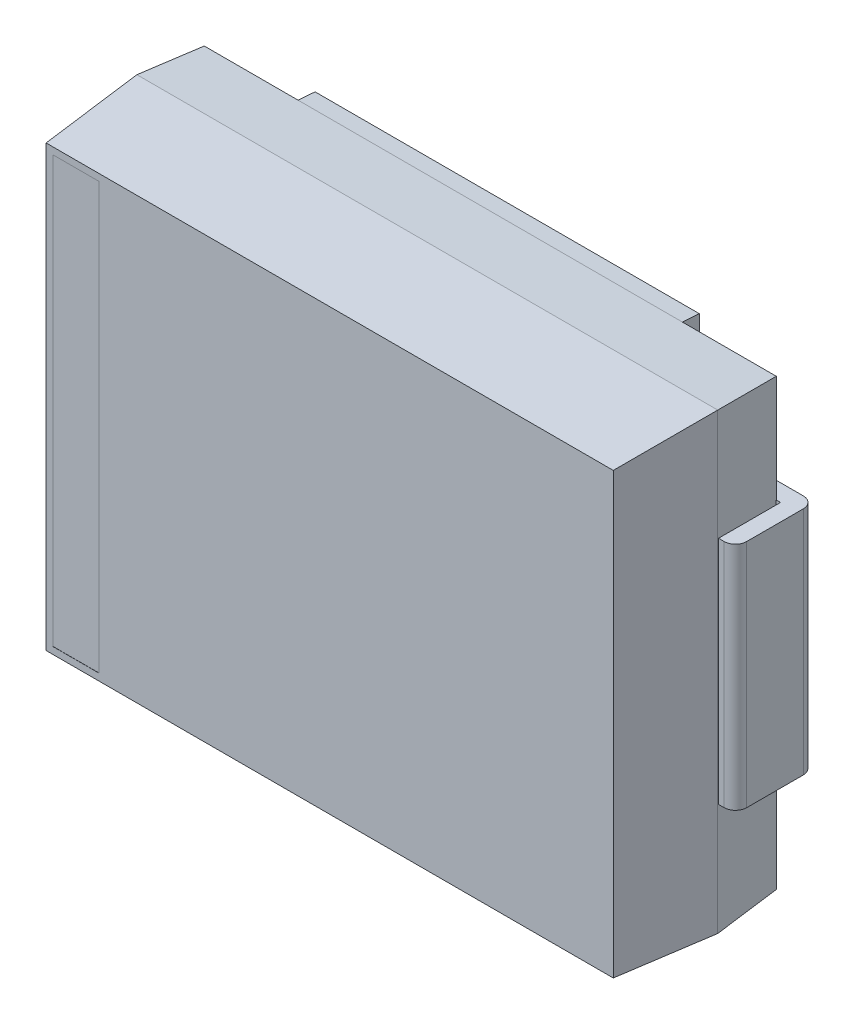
ISO-10303-21;
HEADER;
FILE_DESCRIPTION(('STEP AP214'),'2;1');
FILE_NAME('part.step','',(''),(''),'','','');
FILE_SCHEMA(('AUTOMOTIVE_DESIGN { 1 0 10303 214 1 1 1 1 }'));
ENDSEC;
DATA;
#1=APPLICATION_CONTEXT('core data for automotive mechanical design processes');
#2=APPLICATION_PROTOCOL_DEFINITION('international standard','automotive_design',2000,#1);
#3=PRODUCT_CONTEXT('',#1,'mechanical');
#4=PRODUCT('Part','Part','',(#3));
#5=PRODUCT_RELATED_PRODUCT_CATEGORY('part','',(#4));
#6=PRODUCT_DEFINITION_FORMATION('','',#4);
#7=PRODUCT_DEFINITION_CONTEXT('part definition',#1,'design');
#8=PRODUCT_DEFINITION('design','',#6,#7);
#9=PRODUCT_DEFINITION_SHAPE('','',#8);
#10=(LENGTH_UNIT() NAMED_UNIT(*) SI_UNIT(.MILLI.,.METRE.));
#11=(NAMED_UNIT(*) PLANE_ANGLE_UNIT() SI_UNIT($,.RADIAN.));
#12=(NAMED_UNIT(*) SI_UNIT($,.STERADIAN.) SOLID_ANGLE_UNIT());
#13=UNCERTAINTY_MEASURE_WITH_UNIT(LENGTH_MEASURE(1.E-05),#10,'distance_accuracy_value','');
#14=(GEOMETRIC_REPRESENTATION_CONTEXT(3) GLOBAL_UNCERTAINTY_ASSIGNED_CONTEXT((#13)) GLOBAL_UNIT_ASSIGNED_CONTEXT((#10,
#11,#12)) REPRESENTATION_CONTEXT('',''));
#15=CARTESIAN_POINT('',(0.,0.,0.));
#16=DIRECTION('',(0.,0.,1.));
#17=DIRECTION('',(1.,0.,0.));
#18=AXIS2_PLACEMENT_3D('',#15,#16,#17);
#19=CARTESIAN_POINT('',(-3.001442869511,-2.771442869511,2.3078));
#20=DIRECTION('',(0.,0.,-1.));
#21=DIRECTION('',(0.,-1.,0.));
#22=AXIS2_PLACEMENT_3D('',#19,#20,#21);
#23=PLANE('',#22);
#24=DIRECTION('',(0.,1.,0.));
#25=VECTOR('',#24,1.);
#26=CARTESIAN_POINT('',(-3.001442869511,-2.771442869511,2.3078));
#27=LINE('',#26,#25);
#28=CARTESIAN_POINT('',(-3.001442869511,-2.771442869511,2.3078));
#29=VERTEX_POINT('',#28);
#30=CARTESIAN_POINT('',(-3.001442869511,2.771442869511,2.3078));
#31=VERTEX_POINT('',#30);
#32=EDGE_CURVE('E211',#29,#31,#27,.T.);
#33=ORIENTED_EDGE('',*,*,#32,.T.);
#34=DIRECTION('',(-1.,0.,0.));
#35=VECTOR('',#34,1.);
#36=CARTESIAN_POINT('',(-3.001442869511,2.771442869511,2.3078));
#37=LINE('',#36,#35);
#38=CARTESIAN_POINT('',(-3.601442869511,2.771442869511,2.3078));
#39=VERTEX_POINT('',#38);
#40=EDGE_CURVE('E461',#31,#39,#37,.T.);
#41=ORIENTED_EDGE('',*,*,#40,.T.);
#42=DIRECTION('',(0.,-1.,0.));
#43=VECTOR('',#42,1.);
#44=CARTESIAN_POINT('',(-3.601442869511,2.771442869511,2.3078));
#45=LINE('',#44,#43);
#46=CARTESIAN_POINT('',(-3.601442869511,-2.771442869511,2.3078));
#47=VERTEX_POINT('',#46);
#48=EDGE_CURVE('E39',#39,#47,#45,.T.);
#49=ORIENTED_EDGE('',*,*,#48,.T.);
#50=DIRECTION('',(1.,0.,0.));
#51=VECTOR('',#50,1.);
#52=CARTESIAN_POINT('',(-3.601442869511,-2.771442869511,2.3078));
#53=LINE('',#52,#51);
#54=EDGE_CURVE('E350',#47,#29,#53,.T.);
#55=ORIENTED_EDGE('',*,*,#54,.T.);
#56=EDGE_LOOP('',(#33,#41,#49,#55));
#57=FACE_BOUND('',#56,.T.);
#58=ADVANCED_FACE('F17',(#57),#23,.F.);
#59=CARTESIAN_POINT('',(-4.,-1.5,0.));
#60=DIRECTION('',(-1.,0.,0.));
#61=DIRECTION('',(0.,0.,1.));
#62=AXIS2_PLACEMENT_3D('',#59,#60,#61);
#63=PLANE('',#62);
#64=DIRECTION('',(0.,0.,1.));
#65=VECTOR('',#64,1.);
#66=CARTESIAN_POINT('',(-4.,-1.5,0.));
#67=LINE('',#66,#65);
#68=CARTESIAN_POINT('',(-4.,-1.5,0.146666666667));
#69=VERTEX_POINT('',#68);
#70=CARTESIAN_POINT('',(-4.,-1.5,0.882438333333));
#71=VERTEX_POINT('',#70);
#72=EDGE_CURVE('E728',#69,#71,#67,.T.);
#73=ORIENTED_EDGE('',*,*,#72,.T.);
#74=DIRECTION('',(0.,1.,0.));
#75=VECTOR('',#74,1.);
#76=CARTESIAN_POINT('',(-4.,-1.5,0.882438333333));
#77=LINE('',#76,#75);
#78=CARTESIAN_POINT('',(-4.,1.5,0.882438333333));
#79=VERTEX_POINT('',#78);
#80=EDGE_CURVE('E11',#71,#79,#77,.T.);
#81=ORIENTED_EDGE('',*,*,#80,.T.);
#82=DIRECTION('',(0.,0.,1.));
#83=VECTOR('',#82,1.);
#84=CARTESIAN_POINT('',(-4.,1.5,0.));
#85=LINE('',#84,#83);
#86=CARTESIAN_POINT('',(-4.,1.5,0.146666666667));
#87=VERTEX_POINT('',#86);
#88=EDGE_CURVE('E447',#87,#79,#85,.T.);
#89=ORIENTED_EDGE('',*,*,#88,.F.);
#90=DIRECTION('',(0.,1.,0.));
#91=VECTOR('',#90,1.);
#92=CARTESIAN_POINT('',(-4.,-1.5,0.146666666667));
#93=LINE('',#92,#91);
#94=EDGE_CURVE('E543',#69,#87,#93,.T.);
#95=ORIENTED_EDGE('',*,*,#94,.F.);
#96=EDGE_LOOP('',(#73,#81,#89,#95));
#97=FACE_BOUND('',#96,.T.);
#98=ADVANCED_FACE('F919',(#97),#63,.T.);
#99=CARTESIAN_POINT('',(-3.853333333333,-1.5,0.882438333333));
#100=DIRECTION('',(0.,1.,0.));
#101=DIRECTION('',(-1.,0.,0.));
#102=AXIS2_PLACEMENT_3D('',#99,#100,#101);
#103=CYLINDRICAL_SURFACE('',#102,0.146666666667);
#104=CARTESIAN_POINT('',(-3.853333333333,-1.5,0.882438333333));
#105=DIRECTION('',(0.,1.,0.));
#106=DIRECTION('',(0.,0.,1.));
#107=AXIS2_PLACEMENT_3D('',#104,#105,#106);
#108=CIRCLE('',#107,0.146666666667);
#109=CARTESIAN_POINT('',(-3.853333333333,-1.5,1.029105));
#110=VERTEX_POINT('',#109);
#111=EDGE_CURVE('E741',#71,#110,#108,.T.);
#112=ORIENTED_EDGE('',*,*,#111,.T.);
#113=DIRECTION('',(0.,1.,0.));
#114=VECTOR('',#113,1.);
#115=CARTESIAN_POINT('',(-3.853333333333,-1.5,1.029105));
#116=LINE('',#115,#114);
#117=CARTESIAN_POINT('',(-3.853333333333,1.5,1.029105));
#118=VERTEX_POINT('',#117);
#119=EDGE_CURVE('E26',#110,#118,#116,.T.);
#120=ORIENTED_EDGE('',*,*,#119,.T.);
#121=CARTESIAN_POINT('',(-3.853333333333,1.5,0.882438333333));
#122=DIRECTION('',(0.,1.,0.));
#123=DIRECTION('',(0.,0.,1.));
#124=AXIS2_PLACEMENT_3D('',#121,#122,#123);
#125=CIRCLE('',#124,0.146666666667);
#126=EDGE_CURVE('E442',#79,#118,#125,.T.);
#127=ORIENTED_EDGE('',*,*,#126,.F.);
#128=ORIENTED_EDGE('',*,*,#80,.F.);
#129=EDGE_LOOP('',(#112,#120,#127,#128));
#130=FACE_BOUND('',#129,.T.);
#131=ADVANCED_FACE('F922',(#130),#103,.T.);
#132=CARTESIAN_POINT('',(-3.89,0.,1.029105));
#133=DIRECTION('',(0.,0.,-1.));
#134=DIRECTION('',(0.,-1.,0.));
#135=AXIS2_PLACEMENT_3D('',#132,#133,#134);
#136=PLANE('',#135);
#137=DIRECTION('',(0.,-1.,0.));
#138=VECTOR('',#137,1.);
#139=CARTESIAN_POINT('',(-3.78,1.5,1.029105));
#140=LINE('',#139,#138);
#141=CARTESIAN_POINT('',(-3.78,1.5,1.029105));
#142=VERTEX_POINT('',#141);
#143=CARTESIAN_POINT('',(-3.78,-1.5,1.029105));
#144=VERTEX_POINT('',#143);
#145=EDGE_CURVE('E687',#142,#144,#140,.T.);
#146=ORIENTED_EDGE('',*,*,#145,.F.);
#147=DIRECTION('',(1.,0.,0.));
#148=VECTOR('',#147,1.);
#149=CARTESIAN_POINT('',(-4.,1.5,1.029105));
#150=LINE('',#149,#148);
#151=EDGE_CURVE('E446',#118,#142,#150,.T.);
#152=ORIENTED_EDGE('',*,*,#151,.F.);
#153=ORIENTED_EDGE('',*,*,#119,.F.);
#154=DIRECTION('',(-1.,0.,0.));
#155=VECTOR('',#154,1.);
#156=CARTESIAN_POINT('',(-3.78,-1.5,1.029105));
#157=LINE('',#156,#155);
#158=EDGE_CURVE('E568',#144,#110,#157,.T.);
#159=ORIENTED_EDGE('',*,*,#158,.F.);
#160=EDGE_LOOP('',(#146,#152,#153,#159));
#161=FACE_BOUND('',#160,.T.);
#162=ADVANCED_FACE('F763',(#161),#136,.F.);
#163=CARTESIAN_POINT('',(-3.78,1.5,0.));
#164=DIRECTION('',(1.,0.,0.));
#165=DIRECTION('',(0.,-1.,0.));
#166=AXIS2_PLACEMENT_3D('',#163,#164,#165);
#167=PLANE('',#166);
#168=DIRECTION('',(0.,1.,0.));
#169=VECTOR('',#168,1.);
#170=CARTESIAN_POINT('',(-3.78,-1.5,0.2222));
#171=LINE('',#170,#169);
#172=CARTESIAN_POINT('',(-3.78,-1.5,0.2222));
#173=VERTEX_POINT('',#172);
#174=CARTESIAN_POINT('',(-3.78,1.5,0.2222));
#175=VERTEX_POINT('',#174);
#176=EDGE_CURVE('E744',#173,#175,#171,.T.);
#177=ORIENTED_EDGE('',*,*,#176,.T.);
#178=DIRECTION('',(0.,0.,1.));
#179=VECTOR('',#178,1.);
#180=CARTESIAN_POINT('',(-3.78,1.5,0.));
#181=LINE('',#180,#179);
#182=EDGE_CURVE('E680',#175,#142,#181,.T.);
#183=ORIENTED_EDGE('',*,*,#182,.T.);
#184=ORIENTED_EDGE('',*,*,#145,.T.);
#185=DIRECTION('',(0.,0.,1.));
#186=VECTOR('',#185,1.);
#187=CARTESIAN_POINT('',(-3.78,-1.5,0.));
#188=LINE('',#187,#186);
#189=EDGE_CURVE('E561',#173,#144,#188,.T.);
#190=ORIENTED_EDGE('',*,*,#189,.F.);
#191=EDGE_LOOP('',(#177,#183,#184,#190));
#192=FACE_BOUND('',#191,.T.);
#193=ADVANCED_FACE('F761',(#192),#167,.T.);
#194=CARTESIAN_POINT('',(-3.246666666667,0.,0.));
#195=DIRECTION('',(0.,0.,-1.));
#196=DIRECTION('',(0.,-1.,0.));
#197=AXIS2_PLACEMENT_3D('',#194,#195,#196);
#198=PLANE('',#197);
#199=DIRECTION('',(-1.,0.,0.));
#200=VECTOR('',#199,1.);
#201=CARTESIAN_POINT('',(-3.78,-1.5,0.));
#202=LINE('',#201,#200);
#203=CARTESIAN_POINT('',(-2.64,-1.5,0.));
#204=VERTEX_POINT('',#203);
#205=CARTESIAN_POINT('',(-3.853333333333,-1.5,0.));
#206=VERTEX_POINT('',#205);
#207=EDGE_CURVE('E376',#204,#206,#202,.T.);
#208=ORIENTED_EDGE('',*,*,#207,.T.);
#209=DIRECTION('',(0.,1.,0.));
#210=VECTOR('',#209,1.);
#211=CARTESIAN_POINT('',(-3.853333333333,-1.5,0.));
#212=LINE('',#211,#210);
#213=CARTESIAN_POINT('',(-3.853333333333,1.5,0.));
#214=VERTEX_POINT('',#213);
#215=EDGE_CURVE('E621',#206,#214,#212,.T.);
#216=ORIENTED_EDGE('',*,*,#215,.T.);
#217=DIRECTION('',(1.,0.,0.));
#218=VECTOR('',#217,1.);
#219=CARTESIAN_POINT('',(-3.78,1.5,0.));
#220=LINE('',#219,#218);
#221=CARTESIAN_POINT('',(-2.64,1.5,0.));
#222=VERTEX_POINT('',#221);
#223=EDGE_CURVE('E710',#214,#222,#220,.T.);
#224=ORIENTED_EDGE('',*,*,#223,.T.);
#225=DIRECTION('',(0.,-1.,0.));
#226=VECTOR('',#225,1.);
#227=CARTESIAN_POINT('',(-2.64,1.5,0.));
#228=LINE('',#227,#226);
#229=EDGE_CURVE('E721',#222,#204,#228,.T.);
#230=ORIENTED_EDGE('',*,*,#229,.T.);
#231=EDGE_LOOP('',(#208,#216,#224,#230));
#232=FACE_BOUND('',#231,.T.);
#233=ADVANCED_FACE('F914',(#232),#198,.T.);
#234=CARTESIAN_POINT('',(-3.853333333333,-1.5,0.146666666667));
#235=DIRECTION('',(0.,1.,0.));
#236=DIRECTION('',(-1.,0.,0.));
#237=AXIS2_PLACEMENT_3D('',#234,#235,#236);
#238=CYLINDRICAL_SURFACE('',#237,0.146666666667);
#239=ORIENTED_EDGE('',*,*,#94,.T.);
#240=CARTESIAN_POINT('',(-3.853333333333,1.5,0.146666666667));
#241=DIRECTION('',(0.,-1.,0.));
#242=DIRECTION('',(0.,0.,1.));
#243=AXIS2_PLACEMENT_3D('',#240,#241,#242);
#244=CIRCLE('',#243,0.146666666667);
#245=EDGE_CURVE('E481',#87,#214,#244,.T.);
#246=ORIENTED_EDGE('',*,*,#245,.T.);
#247=ORIENTED_EDGE('',*,*,#215,.F.);
#248=CARTESIAN_POINT('',(-3.853333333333,-1.5,0.146666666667));
#249=DIRECTION('',(0.,-1.,0.));
#250=DIRECTION('',(0.,0.,1.));
#251=AXIS2_PLACEMENT_3D('',#248,#249,#250);
#252=CIRCLE('',#251,0.146666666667);
#253=EDGE_CURVE('E381',#69,#206,#252,.T.);
#254=ORIENTED_EDGE('',*,*,#253,.F.);
#255=EDGE_LOOP('',(#239,#246,#247,#254));
#256=FACE_BOUND('',#255,.T.);
#257=ADVANCED_FACE('F916',(#256),#238,.T.);
#258=CARTESIAN_POINT('',(-3.601442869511,2.771442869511,2.31));
#259=DIRECTION('',(-1.,0.,0.));
#260=DIRECTION('',(0.,0.,1.));
#261=AXIS2_PLACEMENT_3D('',#258,#259,#260);
#262=PLANE('',#261);
#263=CARTESIAN_POINT('',(-3.601442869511,2.771442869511,2.3078));
#264=CARTESIAN_POINT('',(-3.601442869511,2.771442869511,2.31));
#265=(BOUNDED_CURVE() B_SPLINE_CURVE(1,(#263,#264),.UNSPECIFIED.,.F.,
.F.) B_SPLINE_CURVE_WITH_KNOTS((2,2),(0.,1.),
.UNSPECIFIED.) CURVE() GEOMETRIC_REPRESENTATION_ITEM() RATIONAL_B_SPLINE_CURVE((1.,1.)) REPRESENTATION_ITEM(''));
#266=CARTESIAN_POINT('',(-3.601442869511,2.771442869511,2.31));
#267=VERTEX_POINT('',#266);
#268=EDGE_CURVE('E456',#39,#267,#265,.T.);
#269=ORIENTED_EDGE('',*,*,#268,.T.);
#270=DIRECTION('',(0.,-1.,0.));
#271=VECTOR('',#270,1.);
#272=CARTESIAN_POINT('',(-3.601442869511,2.771442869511,2.31));
#273=LINE('',#272,#271);
#274=CARTESIAN_POINT('',(-3.601442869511,-2.771442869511,2.31));
#275=VERTEX_POINT('',#274);
#276=EDGE_CURVE('E631',#267,#275,#273,.T.);
#277=ORIENTED_EDGE('',*,*,#276,.T.);
#278=CARTESIAN_POINT('',(-3.601442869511,-2.771442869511,2.3078));
#279=CARTESIAN_POINT('',(-3.601442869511,-2.771442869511,2.31));
#280=(BOUNDED_CURVE() B_SPLINE_CURVE(1,(#278,#279),.UNSPECIFIED.,.F.,
.F.) B_SPLINE_CURVE_WITH_KNOTS((2,2),(0.,1.),
.UNSPECIFIED.) CURVE() GEOMETRIC_REPRESENTATION_ITEM() RATIONAL_B_SPLINE_CURVE((1.,1.)) REPRESENTATION_ITEM(''));
#281=EDGE_CURVE('E345',#47,#275,#280,.T.);
#282=ORIENTED_EDGE('',*,*,#281,.F.);
#283=ORIENTED_EDGE('',*,*,#48,.F.);
#284=EDGE_LOOP('',(#269,#277,#282,#283));
#285=FACE_BOUND('',#284,.T.);
#286=ADVANCED_FACE('F944',(#285),#262,.F.);
#287=CARTESIAN_POINT('',(-3.601442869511,-2.771442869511,2.31));
#288=DIRECTION('',(0.,-1.,0.));
#289=DIRECTION('',(-1.,0.,0.));
#290=AXIS2_PLACEMENT_3D('',#287,#288,#289);
#291=PLANE('',#290);
#292=ORIENTED_EDGE('',*,*,#281,.T.);
#293=DIRECTION('',(1.,0.,0.));
#294=VECTOR('',#293,1.);
#295=CARTESIAN_POINT('',(-3.601442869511,-2.771442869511,2.31));
#296=LINE('',#295,#294);
#297=CARTESIAN_POINT('',(-3.001442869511,-2.771442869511,2.31));
#298=VERTEX_POINT('',#297);
#299=EDGE_CURVE('E684',#275,#298,#296,.T.);
#300=ORIENTED_EDGE('',*,*,#299,.T.);
#301=CARTESIAN_POINT('',(-3.001442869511,-2.771442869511,2.3078));
#302=CARTESIAN_POINT('',(-3.001442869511,-2.771442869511,2.31));
#303=(BOUNDED_CURVE() B_SPLINE_CURVE(1,(#301,#302),.UNSPECIFIED.,.F.,
.F.) B_SPLINE_CURVE_WITH_KNOTS((2,2),(0.,1.),
.UNSPECIFIED.) CURVE() GEOMETRIC_REPRESENTATION_ITEM() RATIONAL_B_SPLINE_CURVE((1.,1.)) REPRESENTATION_ITEM(''));
#304=EDGE_CURVE('E668',#29,#298,#303,.T.);
#305=ORIENTED_EDGE('',*,*,#304,.F.);
#306=ORIENTED_EDGE('',*,*,#54,.F.);
#307=EDGE_LOOP('',(#292,#300,#305,#306));
#308=FACE_BOUND('',#307,.T.);
#309=ADVANCED_FACE('F948',(#308),#291,.F.);
#310=CARTESIAN_POINT('',(-3.001442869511,-2.771442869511,2.31));
#311=DIRECTION('',(1.,0.,0.));
#312=DIRECTION('',(0.,-1.,0.));
#313=AXIS2_PLACEMENT_3D('',#310,#311,#312);
#314=PLANE('',#313);
#315=ORIENTED_EDGE('',*,*,#304,.T.);
#316=DIRECTION('',(0.,1.,0.));
#317=VECTOR('',#316,1.);
#318=CARTESIAN_POINT('',(-3.001442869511,-2.771442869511,2.31));
#319=LINE('',#318,#317);
#320=CARTESIAN_POINT('',(-3.001442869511,2.771442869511,2.31));
#321=VERTEX_POINT('',#320);
#322=EDGE_CURVE('E676',#298,#321,#319,.T.);
#323=ORIENTED_EDGE('',*,*,#322,.T.);
#324=CARTESIAN_POINT('',(-3.001442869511,2.771442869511,2.3078));
#325=CARTESIAN_POINT('',(-3.001442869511,2.771442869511,2.31));
#326=(BOUNDED_CURVE() B_SPLINE_CURVE(1,(#324,#325),.UNSPECIFIED.,.F.,
.F.) B_SPLINE_CURVE_WITH_KNOTS((2,2),(0.,1.),
.UNSPECIFIED.) CURVE() GEOMETRIC_REPRESENTATION_ITEM() RATIONAL_B_SPLINE_CURVE((1.,1.)) REPRESENTATION_ITEM(''));
#327=EDGE_CURVE('E462',#31,#321,#326,.T.);
#328=ORIENTED_EDGE('',*,*,#327,.F.);
#329=ORIENTED_EDGE('',*,*,#32,.F.);
#330=EDGE_LOOP('',(#315,#323,#328,#329));
#331=FACE_BOUND('',#330,.T.);
#332=ADVANCED_FACE('F957',(#331),#314,.F.);
#333=CARTESIAN_POINT('',(-3.001442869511,2.771442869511,2.31));
#334=DIRECTION('',(0.,1.,0.));
#335=DIRECTION('',(1.,0.,0.));
#336=AXIS2_PLACEMENT_3D('',#333,#334,#335);
#337=PLANE('',#336);
#338=ORIENTED_EDGE('',*,*,#327,.T.);
#339=DIRECTION('',(-1.,0.,0.));
#340=VECTOR('',#339,1.);
#341=CARTESIAN_POINT('',(-3.001442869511,2.771442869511,2.31));
#342=LINE('',#341,#340);
#343=EDGE_CURVE('E627',#321,#267,#342,.T.);
#344=ORIENTED_EDGE('',*,*,#343,.T.);
#345=ORIENTED_EDGE('',*,*,#268,.F.);
#346=ORIENTED_EDGE('',*,*,#40,.F.);
#347=EDGE_LOOP('',(#338,#344,#345,#346));
#348=FACE_BOUND('',#347,.T.);
#349=ADVANCED_FACE('F966',(#348),#337,.F.);
#350=CARTESIAN_POINT('',(-3.21,0.,0.2222));
#351=DIRECTION('',(0.,0.,-1.));
#352=DIRECTION('',(0.,-1.,0.));
#353=AXIS2_PLACEMENT_3D('',#350,#351,#352);
#354=PLANE('',#353);
#355=DIRECTION('',(1.,0.,0.));
#356=VECTOR('',#355,1.);
#357=CARTESIAN_POINT('',(-3.78,1.5,0.2222));
#358=LINE('',#357,#356);
#359=CARTESIAN_POINT('',(-3.722567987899,1.5,0.2222));
#360=VERTEX_POINT('',#359);
#361=EDGE_CURVE('E704',#175,#360,#358,.T.);
#362=ORIENTED_EDGE('',*,*,#361,.F.);
#363=ORIENTED_EDGE('',*,*,#176,.F.);
#364=DIRECTION('',(-1.,0.,0.));
#365=VECTOR('',#364,1.);
#366=CARTESIAN_POINT('',(-2.64,-1.5,0.2222));
#367=LINE('',#366,#365);
#368=CARTESIAN_POINT('',(-3.722567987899,-1.5,0.2222));
#369=VERTEX_POINT('',#368);
#370=EDGE_CURVE('E380',#369,#173,#367,.T.);
#371=ORIENTED_EDGE('',*,*,#370,.F.);
#372=CARTESIAN_POINT('',(-3.722567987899,-1.5,0.2222));
#373=CARTESIAN_POINT('',(-3.722567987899,1.5,0.2222));
#374=(BOUNDED_CURVE() B_SPLINE_CURVE(1,(#372,#373),.UNSPECIFIED.,.F.,
.F.) B_SPLINE_CURVE_WITH_KNOTS((2,2),(0.,1.),
.UNSPECIFIED.) CURVE() GEOMETRIC_REPRESENTATION_ITEM() RATIONAL_B_SPLINE_CURVE((1.,1.)) REPRESENTATION_ITEM(''));
#375=EDGE_CURVE('E605',#369,#360,#374,.T.);
#376=ORIENTED_EDGE('',*,*,#375,.T.);
#377=EDGE_LOOP('',(#362,#363,#371,#376));
#378=FACE_BOUND('',#377,.T.);
#379=ADVANCED_FACE('F773',(#378),#354,.F.);
#380=CARTESIAN_POINT('',(-3.78,2.95,1.0395));
#381=CARTESIAN_POINT('',(-3.690721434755,2.860721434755,2.31));
#382=CARTESIAN_POINT('',(-3.78,-2.95,1.0395));
#383=CARTESIAN_POINT('',(-3.690721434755,-2.860721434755,2.31));
#384=(BOUNDED_SURFACE() B_SPLINE_SURFACE(1,1,((#380,#381),(#382,#383)),.UNSPECIFIED.,.F.,.F.,
.F.) B_SPLINE_SURFACE_WITH_KNOTS((2,2),(2,2),(0.,5.9),(0.,1.),
.UNSPECIFIED.) GEOMETRIC_REPRESENTATION_ITEM() RATIONAL_B_SPLINE_SURFACE(((1.,1.),(1.,1.))) REPRESENTATION_ITEM('') SURFACE());
#385=DIRECTION('',(0.,-1.,0.));
#386=VECTOR('',#385,1.);
#387=CARTESIAN_POINT('',(-3.78,2.95,1.0395));
#388=LINE('',#387,#386);
#389=CARTESIAN_POINT('',(-3.78,2.95,1.0395));
#390=VERTEX_POINT('',#389);
#391=CARTESIAN_POINT('',(-3.78,-2.95,1.0395));
#392=VERTEX_POINT('',#391);
#393=EDGE_CURVE('E470',#390,#392,#388,.T.);
#394=CARTESIAN_POINT('',(-3.78,-2.95,1.0395));
#395=CARTESIAN_POINT('',(-3.690721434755,-2.860721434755,2.31));
#396=(BOUNDED_CURVE() B_SPLINE_CURVE(1,(#394,#395),.UNSPECIFIED.,.F.,
.F.) B_SPLINE_CURVE_WITH_KNOTS((2,2),(0.,1.),
.UNSPECIFIED.) CURVE() GEOMETRIC_REPRESENTATION_ITEM() RATIONAL_B_SPLINE_CURVE((1.,1.)) REPRESENTATION_ITEM(''));
#397=CARTESIAN_POINT('',(-3.690721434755,-2.860721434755,2.31));
#398=VERTEX_POINT('',#397);
#399=EDGE_CURVE('E301',#392,#398,#396,.T.);
#400=DIRECTION('',(0.,-1.,0.));
#401=VECTOR('',#400,1.);
#402=CARTESIAN_POINT('',(-3.690721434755,2.860721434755,2.31));
#403=LINE('',#402,#401);
#404=CARTESIAN_POINT('',(-3.690721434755,2.860721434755,2.31));
#405=VERTEX_POINT('',#404);
#406=EDGE_CURVE('E673',#405,#398,#403,.T.);
#407=CARTESIAN_POINT('',(-3.78,2.95,1.0395));
#408=CARTESIAN_POINT('',(-3.690721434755,2.860721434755,2.31));
#409=(BOUNDED_CURVE() B_SPLINE_CURVE(1,(#407,#408),.UNSPECIFIED.,.F.,
.F.) B_SPLINE_CURVE_WITH_KNOTS((2,2),(0.,1.),
.UNSPECIFIED.) CURVE() GEOMETRIC_REPRESENTATION_ITEM() RATIONAL_B_SPLINE_CURVE((1.,1.)) REPRESENTATION_ITEM(''));
#410=EDGE_CURVE('E662',#390,#405,#409,.T.);
#411=ORIENTED_EDGE('',*,*,#393,.T.);
#412=ORIENTED_EDGE('',*,*,#399,.T.);
#413=ORIENTED_EDGE('',*,*,#406,.F.);
#414=ORIENTED_EDGE('',*,*,#410,.F.);
#415=EDGE_LOOP('',(#411,#412,#413,#414));
#416=FACE_BOUND('',#415,.T.);
#417=ADVANCED_FACE('F981',(#416),#384,.T.);
#418=CARTESIAN_POINT('',(-2.5,2.876953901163,0.));
#419=CARTESIAN_POINT('',(-2.5,2.892413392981,0.22));
#420=CARTESIAN_POINT('',(-2.5,-2.876953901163,0.));
#421=CARTESIAN_POINT('',(-2.5,-2.892413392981,0.22));
#422=(BOUNDED_SURFACE() B_SPLINE_SURFACE(1,1,((#418,#419),(#420,#421)),.UNSPECIFIED.,.F.,.F.,
.F.) B_SPLINE_SURFACE_WITH_KNOTS((2,2),(2,2),(0.,5.784826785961),(0.,1.),
.UNSPECIFIED.) GEOMETRIC_REPRESENTATION_ITEM() RATIONAL_B_SPLINE_SURFACE(((1.,1.),(1.,1.))) REPRESENTATION_ITEM('') SURFACE());
#423=DIRECTION('',(0.,-1.,0.));
#424=VECTOR('',#423,1.);
#425=CARTESIAN_POINT('',(-2.5,2.876953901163,0.));
#426=LINE('',#425,#424);
#427=CARTESIAN_POINT('',(-2.5,2.876953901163,0.));
#428=VERTEX_POINT('',#427);
#429=CARTESIAN_POINT('',(-2.5,-2.876953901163,0.));
#430=VERTEX_POINT('',#429);
#431=EDGE_CURVE('E578',#428,#430,#426,.T.);
#432=CARTESIAN_POINT('',(-2.5,-2.876953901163,0.));
#433=CARTESIAN_POINT('',(-2.5,-2.892413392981,0.22));
#434=(BOUNDED_CURVE() B_SPLINE_CURVE(1,(#432,#433),.UNSPECIFIED.,.F.,
.F.) B_SPLINE_CURVE_WITH_KNOTS((2,2),(0.,1.),
.UNSPECIFIED.) CURVE() GEOMETRIC_REPRESENTATION_ITEM() RATIONAL_B_SPLINE_CURVE((1.,1.)) REPRESENTATION_ITEM(''));
#435=CARTESIAN_POINT('',(-2.5,-2.892413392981,0.22));
#436=VERTEX_POINT('',#435);
#437=EDGE_CURVE('E469',#430,#436,#434,.T.);
#438=DIRECTION('',(0.,-1.,0.));
#439=VECTOR('',#438,1.);
#440=CARTESIAN_POINT('',(-2.5,2.892413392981,0.22));
#441=LINE('',#440,#439);
#442=CARTESIAN_POINT('',(-2.5,2.892413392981,0.22));
#443=VERTEX_POINT('',#442);
#444=EDGE_CURVE('E507',#443,#436,#441,.T.);
#445=CARTESIAN_POINT('',(-2.5,2.876953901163,0.));
#446=CARTESIAN_POINT('',(-2.5,2.892413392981,0.22));
#447=(BOUNDED_CURVE() B_SPLINE_CURVE(1,(#445,#446),.UNSPECIFIED.,.F.,
.F.) B_SPLINE_CURVE_WITH_KNOTS((2,2),(0.,1.),
.UNSPECIFIED.) CURVE() GEOMETRIC_REPRESENTATION_ITEM() RATIONAL_B_SPLINE_CURVE((1.,1.)) REPRESENTATION_ITEM(''));
#448=EDGE_CURVE('E573',#428,#443,#447,.T.);
#449=ORIENTED_EDGE('',*,*,#431,.T.);
#450=ORIENTED_EDGE('',*,*,#437,.T.);
#451=ORIENTED_EDGE('',*,*,#444,.F.);
#452=ORIENTED_EDGE('',*,*,#448,.F.);
#453=EDGE_LOOP('',(#449,#450,#451,#452));
#454=FACE_BOUND('',#453,.T.);
#455=ADVANCED_FACE('F900',(#454),#422,.T.);
#456=CARTESIAN_POINT('',(-3.49795115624,-1.5,0.316605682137));
#457=DIRECTION('',(0.,-1.,0.));
#458=DIRECTION('',(-1.,0.,0.));
#459=AXIS2_PLACEMENT_3D('',#456,#457,#458);
#460=PLANE('',#459);
#461=ORIENTED_EDGE('',*,*,#72,.F.);
#462=ORIENTED_EDGE('',*,*,#253,.T.);
#463=ORIENTED_EDGE('',*,*,#207,.F.);
#464=DIRECTION('',(0.,0.,1.));
#465=VECTOR('',#464,1.);
#466=CARTESIAN_POINT('',(-2.64,-1.5,0.));
#467=LINE('',#466,#465);
#468=CARTESIAN_POINT('',(-2.64,-1.5,0.22));
#469=VERTEX_POINT('',#468);
#470=EDGE_CURVE('E725',#204,#469,#467,.T.);
#471=ORIENTED_EDGE('',*,*,#470,.T.);
#472=DIRECTION('',(1.,0.,0.));
#473=VECTOR('',#472,1.);
#474=CARTESIAN_POINT('',(0.11223111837,-1.5,0.22));
#475=LINE('',#474,#473);
#476=CARTESIAN_POINT('',(-3.722413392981,-1.5,0.22));
#477=VERTEX_POINT('',#476);
#478=EDGE_CURVE('E604',#477,#469,#475,.T.);
#479=ORIENTED_EDGE('',*,*,#478,.F.);
#480=CARTESIAN_POINT('',(-3.722413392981,-1.5,0.22));
#481=CARTESIAN_POINT('',(-3.736627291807,-1.5,0.422274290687));
#482=CARTESIAN_POINT('',(-3.750841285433,-1.5,0.624549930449));
#483=CARTESIAN_POINT('',(-3.765055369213,-1.5,0.826826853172));
#484=CARTESIAN_POINT('',(-3.779269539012,-1.5,1.029105));
#485=(BOUNDED_CURVE() B_SPLINE_CURVE(4,(#480,#481,#482,#483,#484),.UNSPECIFIED.,.F.,
.F.) B_SPLINE_CURVE_WITH_KNOTS((5,5),(0.,1.),
.UNSPECIFIED.) CURVE() GEOMETRIC_REPRESENTATION_ITEM() RATIONAL_B_SPLINE_CURVE((1.,1.,1.,1.,1.)) REPRESENTATION_ITEM(''));
#486=EDGE_CURVE('E547',#477,#369,#485,.T.);
#487=ORIENTED_EDGE('',*,*,#486,.T.);
#488=ORIENTED_EDGE('',*,*,#370,.T.);
#489=ORIENTED_EDGE('',*,*,#189,.T.);
#490=ORIENTED_EDGE('',*,*,#158,.T.);
#491=ORIENTED_EDGE('',*,*,#111,.F.);
#492=EDGE_LOOP('',(#461,#462,#463,#471,#479,#487,#488,#489,#490,#491));
#493=FACE_BOUND('',#492,.T.);
#494=ADVANCED_FACE('F767',(#493),#460,.T.);
#495=CARTESIAN_POINT('',(-2.64,1.5,0.));
#496=DIRECTION('',(1.,0.,0.));
#497=DIRECTION('',(0.,-1.,0.));
#498=AXIS2_PLACEMENT_3D('',#495,#496,#497);
#499=PLANE('',#498);
#500=ORIENTED_EDGE('',*,*,#229,.F.);
#501=DIRECTION('',(0.,0.,1.));
#502=VECTOR('',#501,1.);
#503=CARTESIAN_POINT('',(-2.64,1.5,0.));
#504=LINE('',#503,#502);
#505=CARTESIAN_POINT('',(-2.64,1.5,0.22));
#506=VERTEX_POINT('',#505);
#507=EDGE_CURVE('E707',#222,#506,#504,.T.);
#508=ORIENTED_EDGE('',*,*,#507,.T.);
#509=DIRECTION('',(0.,1.,0.));
#510=VECTOR('',#509,1.);
#511=CARTESIAN_POINT('',(-2.64,-0.69620669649,0.22));
#512=LINE('',#511,#510);
#513=EDGE_CURVE('E618',#469,#506,#512,.T.);
#514=ORIENTED_EDGE('',*,*,#513,.F.);
#515=ORIENTED_EDGE('',*,*,#470,.F.);
#516=EDGE_LOOP('',(#500,#508,#514,#515));
#517=FACE_BOUND('',#516,.T.);
#518=ADVANCED_FACE('F879',(#517),#499,.T.);
#519=CARTESIAN_POINT('',(-3.49795115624,1.5,0.316605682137));
#520=DIRECTION('',(0.,1.,0.));
#521=DIRECTION('',(1.,0.,0.));
#522=AXIS2_PLACEMENT_3D('',#519,#520,#521);
#523=PLANE('',#522);
#524=ORIENTED_EDGE('',*,*,#245,.F.);
#525=ORIENTED_EDGE('',*,*,#88,.T.);
#526=ORIENTED_EDGE('',*,*,#126,.T.);
#527=ORIENTED_EDGE('',*,*,#151,.T.);
#528=ORIENTED_EDGE('',*,*,#182,.F.);
#529=ORIENTED_EDGE('',*,*,#361,.T.);
#530=CARTESIAN_POINT('',(-3.722413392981,1.5,0.22));
#531=CARTESIAN_POINT('',(-3.736627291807,1.5,0.422274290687));
#532=CARTESIAN_POINT('',(-3.750841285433,1.5,0.624549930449));
#533=CARTESIAN_POINT('',(-3.765055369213,1.5,0.826826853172));
#534=CARTESIAN_POINT('',(-3.779269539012,1.5,1.029105));
#535=(BOUNDED_CURVE() B_SPLINE_CURVE(4,(#530,#531,#532,#533,#534),.UNSPECIFIED.,.F.,
.F.) B_SPLINE_CURVE_WITH_KNOTS((5,5),(0.,1.),
.UNSPECIFIED.) CURVE() GEOMETRIC_REPRESENTATION_ITEM() RATIONAL_B_SPLINE_CURVE((1.,1.,1.,1.,1.)) REPRESENTATION_ITEM(''));
#536=CARTESIAN_POINT('',(-3.722413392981,1.5,0.22));
#537=VERTEX_POINT('',#536);
#538=EDGE_CURVE('E611',#537,#360,#535,.T.);
#539=ORIENTED_EDGE('',*,*,#538,.F.);
#540=DIRECTION('',(-1.,0.,0.));
#541=VECTOR('',#540,1.);
#542=CARTESIAN_POINT('',(0.11223111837,1.5,0.22));
#543=LINE('',#542,#541);
#544=EDGE_CURVE('E622',#506,#537,#543,.T.);
#545=ORIENTED_EDGE('',*,*,#544,.F.);
#546=ORIENTED_EDGE('',*,*,#507,.F.);
#547=ORIENTED_EDGE('',*,*,#223,.F.);
#548=EDGE_LOOP('',(#524,#525,#526,#527,#528,#529,#539,#545,#546,#547));
#549=FACE_BOUND('',#548,.T.);
#550=ADVANCED_FACE('F884',(#549),#523,.T.);
#551=CARTESIAN_POINT('',(2.5,-2.876953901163,0.));
#552=DIRECTION('',(0.,0.,-1.));
#553=DIRECTION('',(0.,-1.,0.));
#554=AXIS2_PLACEMENT_3D('',#551,#552,#553);
#555=PLANE('',#554);
#556=DIRECTION('',(1.,0.,0.));
#557=VECTOR('',#556,1.);
#558=CARTESIAN_POINT('',(-2.5,-2.876953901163,0.));
#559=LINE('',#558,#557);
#560=CARTESIAN_POINT('',(2.5,-2.876953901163,0.));
#561=VERTEX_POINT('',#560);
#562=EDGE_CURVE('E463',#430,#561,#559,.T.);
#563=ORIENTED_EDGE('',*,*,#562,.F.);
#564=ORIENTED_EDGE('',*,*,#431,.F.);
#565=DIRECTION('',(-1.,0.,0.));
#566=VECTOR('',#565,1.);
#567=CARTESIAN_POINT('',(2.5,2.876953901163,0.));
#568=LINE('',#567,#566);
#569=CARTESIAN_POINT('',(2.5,2.876953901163,0.));
#570=VERTEX_POINT('',#569);
#571=EDGE_CURVE('E579',#570,#428,#568,.T.);
#572=ORIENTED_EDGE('',*,*,#571,.F.);
#573=DIRECTION('',(0.,1.,0.));
#574=VECTOR('',#573,1.);
#575=CARTESIAN_POINT('',(2.5,-2.876953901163,0.));
#576=LINE('',#575,#574);
#577=EDGE_CURVE('E409',#561,#570,#576,.T.);
#578=ORIENTED_EDGE('',*,*,#577,.F.);
#579=EDGE_LOOP('',(#563,#564,#572,#578));
#580=FACE_BOUND('',#579,.T.);
#581=ADVANCED_FACE('F908',(#580),#555,.T.);
#582=CARTESIAN_POINT('',(2.5,2.892413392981,0.22));
#583=DIRECTION('',(0.,0.997540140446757,-0.0700975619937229));
#584=DIRECTION('',(-1.,0.,0.));
#585=AXIS2_PLACEMENT_3D('',#582,#583,#584);
#586=PLANE('',#585);
#587=ORIENTED_EDGE('',*,*,#571,.T.);
#588=ORIENTED_EDGE('',*,*,#448,.T.);
#589=DIRECTION('',(-1.,0.,0.));
#590=VECTOR('',#589,1.);
#591=CARTESIAN_POINT('',(2.5,2.892413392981,0.22));
#592=LINE('',#591,#590);
#593=CARTESIAN_POINT('',(2.5,2.892413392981,0.22));
#594=VERTEX_POINT('',#593);
#595=EDGE_CURVE('E295',#594,#443,#592,.T.);
#596=ORIENTED_EDGE('',*,*,#595,.F.);
#597=CARTESIAN_POINT('',(2.5,2.876953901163,0.));
#598=CARTESIAN_POINT('',(2.5,2.892413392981,0.22));
#599=(BOUNDED_CURVE() B_SPLINE_CURVE(1,(#597,#598),.UNSPECIFIED.,.F.,
.F.) B_SPLINE_CURVE_WITH_KNOTS((2,2),(0.,1.),
.UNSPECIFIED.) CURVE() GEOMETRIC_REPRESENTATION_ITEM() RATIONAL_B_SPLINE_CURVE((1.,1.)) REPRESENTATION_ITEM(''));
#600=EDGE_CURVE('E413',#570,#594,#599,.T.);
#601=ORIENTED_EDGE('',*,*,#600,.F.);
#602=EDGE_LOOP('',(#587,#588,#596,#601));
#603=FACE_BOUND('',#602,.T.);
#604=ADVANCED_FACE('F897',(#603),#586,.T.);
#605=CARTESIAN_POINT('',(3.690721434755,-2.860721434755,2.31));
#606=DIRECTION('',(0.,0.,-1.));
#607=DIRECTION('',(0.,-1.,0.));
#608=AXIS2_PLACEMENT_3D('',#605,#606,#607);
#609=PLANE('',#608);
#610=ORIENTED_EDGE('',*,*,#322,.F.);
#611=ORIENTED_EDGE('',*,*,#299,.F.);
#612=ORIENTED_EDGE('',*,*,#276,.F.);
#613=ORIENTED_EDGE('',*,*,#343,.F.);
#614=EDGE_LOOP('',(#610,#611,#612,#613));
#615=FACE_BOUND('',#614,.T.);
#616=DIRECTION('',(-1.,0.,0.));
#617=VECTOR('',#616,1.);
#618=CARTESIAN_POINT('',(3.690721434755,2.860721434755,2.31));
#619=LINE('',#618,#617);
#620=CARTESIAN_POINT('',(3.690721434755,2.860721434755,2.31));
#621=VERTEX_POINT('',#620);
#622=EDGE_CURVE('E669',#621,#405,#619,.T.);
#623=ORIENTED_EDGE('',*,*,#622,.T.);
#624=ORIENTED_EDGE('',*,*,#406,.T.);
#625=DIRECTION('',(1.,0.,0.));
#626=VECTOR('',#625,1.);
#627=CARTESIAN_POINT('',(-3.690721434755,-2.860721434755,2.31));
#628=LINE('',#627,#626);
#629=CARTESIAN_POINT('',(3.690721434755,-2.860721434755,2.31));
#630=VERTEX_POINT('',#629);
#631=EDGE_CURVE('E524',#398,#630,#628,.T.);
#632=ORIENTED_EDGE('',*,*,#631,.T.);
#633=DIRECTION('',(0.,1.,0.));
#634=VECTOR('',#633,1.);
#635=CARTESIAN_POINT('',(3.690721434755,-2.860721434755,2.31));
#636=LINE('',#635,#634);
#637=EDGE_CURVE('E291',#630,#621,#636,.T.);
#638=ORIENTED_EDGE('',*,*,#637,.T.);
#639=EDGE_LOOP('',(#623,#624,#632,#638));
#640=FACE_BOUND('',#639,.T.);
#641=ADVANCED_FACE('F1009',(#615,#640),#609,.F.);
#642=CARTESIAN_POINT('',(3.78,2.95,1.0395));
#643=CARTESIAN_POINT('',(3.690721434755,2.860721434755,2.31));
#644=CARTESIAN_POINT('',(-3.78,2.95,1.0395));
#645=CARTESIAN_POINT('',(-3.690721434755,2.860721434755,2.31));
#646=(BOUNDED_SURFACE() B_SPLINE_SURFACE(1,1,((#642,#643),(#644,#645)),.UNSPECIFIED.,.F.,.F.,
.F.) B_SPLINE_SURFACE_WITH_KNOTS((2,2),(2,2),(0.,7.56),(0.,1.),
.UNSPECIFIED.) GEOMETRIC_REPRESENTATION_ITEM() RATIONAL_B_SPLINE_SURFACE(((1.,1.),(1.,1.))) REPRESENTATION_ITEM('') SURFACE());
#647=DIRECTION('',(-1.,0.,0.));
#648=VECTOR('',#647,1.);
#649=CARTESIAN_POINT('',(3.78,2.95,1.0395));
#650=LINE('',#649,#648);
#651=CARTESIAN_POINT('',(3.78,2.95,1.0395));
#652=VERTEX_POINT('',#651);
#653=EDGE_CURVE('E414',#652,#390,#650,.T.);
#654=CARTESIAN_POINT('',(3.78,2.95,1.0395));
#655=CARTESIAN_POINT('',(3.690721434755,2.860721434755,2.31));
#656=(BOUNDED_CURVE() B_SPLINE_CURVE(1,(#654,#655),.UNSPECIFIED.,.F.,
.F.) B_SPLINE_CURVE_WITH_KNOTS((2,2),(0.,1.),
.UNSPECIFIED.) CURVE() GEOMETRIC_REPRESENTATION_ITEM() RATIONAL_B_SPLINE_CURVE((1.,1.)) REPRESENTATION_ITEM(''));
#657=EDGE_CURVE('E387',#652,#621,#656,.T.);
#658=ORIENTED_EDGE('',*,*,#653,.T.);
#659=ORIENTED_EDGE('',*,*,#410,.T.);
#660=ORIENTED_EDGE('',*,*,#622,.F.);
#661=ORIENTED_EDGE('',*,*,#657,.F.);
#662=EDGE_LOOP('',(#658,#659,#660,#661));
#663=FACE_BOUND('',#662,.T.);
#664=ADVANCED_FACE('F1017',(#663),#646,.T.);
#665=CARTESIAN_POINT('',(-3.78,-2.95,1.0395));
#666=CARTESIAN_POINT('',(-3.690721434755,-2.860721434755,2.31));
#667=CARTESIAN_POINT('',(3.78,-2.95,1.0395));
#668=CARTESIAN_POINT('',(3.690721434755,-2.860721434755,2.31));
#669=(BOUNDED_SURFACE() B_SPLINE_SURFACE(1,1,((#665,#666),(#667,#668)),.UNSPECIFIED.,.F.,.F.,
.F.) B_SPLINE_SURFACE_WITH_KNOTS((2,2),(2,2),(0.,7.56),(0.,1.),
.UNSPECIFIED.) GEOMETRIC_REPRESENTATION_ITEM() RATIONAL_B_SPLINE_SURFACE(((1.,1.),(1.,1.))) REPRESENTATION_ITEM('') SURFACE());
#670=DIRECTION('',(1.,0.,0.));
#671=VECTOR('',#670,1.);
#672=CARTESIAN_POINT('',(-3.78,-2.95,1.0395));
#673=LINE('',#672,#671);
#674=CARTESIAN_POINT('',(3.78,-2.95,1.0395));
#675=VERTEX_POINT('',#674);
#676=EDGE_CURVE('E298',#392,#675,#673,.T.);
#677=CARTESIAN_POINT('',(3.78,-2.95,1.0395));
#678=CARTESIAN_POINT('',(3.690721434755,-2.860721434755,2.31));
#679=(BOUNDED_CURVE() B_SPLINE_CURVE(1,(#677,#678),.UNSPECIFIED.,.F.,
.F.) B_SPLINE_CURVE_WITH_KNOTS((2,2),(0.,1.),
.UNSPECIFIED.) CURVE() GEOMETRIC_REPRESENTATION_ITEM() RATIONAL_B_SPLINE_CURVE((1.,1.)) REPRESENTATION_ITEM(''));
#680=EDGE_CURVE('E283',#675,#630,#679,.T.);
#681=ORIENTED_EDGE('',*,*,#676,.T.);
#682=ORIENTED_EDGE('',*,*,#680,.T.);
#683=ORIENTED_EDGE('',*,*,#631,.F.);
#684=ORIENTED_EDGE('',*,*,#399,.F.);
#685=EDGE_LOOP('',(#681,#682,#683,#684));
#686=FACE_BOUND('',#685,.T.);
#687=ADVANCED_FACE('F299',(#686),#669,.T.);
#688=CARTESIAN_POINT('',(-2.5,-2.892413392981,0.22));
#689=DIRECTION('',(0.,-0.997540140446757,-0.0700975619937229));
#690=DIRECTION('',(0.,0.0700975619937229,-0.997540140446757));
#691=AXIS2_PLACEMENT_3D('',#688,#689,#690);
#692=PLANE('',#691);
#693=ORIENTED_EDGE('',*,*,#562,.T.);
#694=CARTESIAN_POINT('',(2.5,-2.876953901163,0.));
#695=CARTESIAN_POINT('',(2.5,-2.892413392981,0.22));
#696=(BOUNDED_CURVE() B_SPLINE_CURVE(1,(#694,#695),.UNSPECIFIED.,.F.,
.F.) B_SPLINE_CURVE_WITH_KNOTS((2,2),(0.,1.),
.UNSPECIFIED.) CURVE() GEOMETRIC_REPRESENTATION_ITEM() RATIONAL_B_SPLINE_CURVE((1.,1.)) REPRESENTATION_ITEM(''));
#697=CARTESIAN_POINT('',(2.5,-2.892413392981,0.22));
#698=VERTEX_POINT('',#697);
#699=EDGE_CURVE('E502',#561,#698,#696,.T.);
#700=ORIENTED_EDGE('',*,*,#699,.T.);
#701=DIRECTION('',(1.,0.,0.));
#702=VECTOR('',#701,1.);
#703=CARTESIAN_POINT('',(-2.5,-2.892413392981,0.22));
#704=LINE('',#703,#702);
#705=EDGE_CURVE('E306',#436,#698,#704,.T.);
#706=ORIENTED_EDGE('',*,*,#705,.F.);
#707=ORIENTED_EDGE('',*,*,#437,.F.);
#708=EDGE_LOOP('',(#693,#700,#706,#707));
#709=FACE_BOUND('',#708,.T.);
#710=ADVANCED_FACE('F904',(#709),#692,.T.);
#711=CARTESIAN_POINT('',(-3.722413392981,2.892413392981,0.22));
#712=CARTESIAN_POINT('',(-3.78,2.95,1.0395));
#713=CARTESIAN_POINT('',(-3.722413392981,-2.892413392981,0.22));
#714=CARTESIAN_POINT('',(-3.78,-2.95,1.0395));
#715=(BOUNDED_SURFACE() B_SPLINE_SURFACE(1,1,((#711,#712),(#713,#714)),.UNSPECIFIED.,.F.,.F.,
.F.) B_SPLINE_SURFACE_WITH_KNOTS((2,2),(2,2),(0.,5.9),(0.,1.),
.UNSPECIFIED.) GEOMETRIC_REPRESENTATION_ITEM() RATIONAL_B_SPLINE_SURFACE(((1.,1.),(1.,1.))) REPRESENTATION_ITEM('') SURFACE());
#716=CARTESIAN_POINT('',(-3.722413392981,2.892413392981,0.22));
#717=CARTESIAN_POINT('',(-3.78,2.95,1.0395));
#718=(BOUNDED_CURVE() B_SPLINE_CURVE(1,(#716,#717),.UNSPECIFIED.,.F.,
.F.) B_SPLINE_CURVE_WITH_KNOTS((2,2),(0.,1.),
.UNSPECIFIED.) CURVE() GEOMETRIC_REPRESENTATION_ITEM() RATIONAL_B_SPLINE_CURVE((1.,1.)) REPRESENTATION_ITEM(''));
#719=CARTESIAN_POINT('',(-3.722413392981,2.892413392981,0.22));
#720=VERTEX_POINT('',#719);
#721=EDGE_CURVE('E580',#720,#390,#718,.T.);
#722=DIRECTION('',(0.,-1.,0.));
#723=VECTOR('',#722,1.);
#724=CARTESIAN_POINT('',(-3.722413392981,2.892413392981,0.22));
#725=LINE('',#724,#723);
#726=EDGE_CURVE('E626',#720,#537,#725,.T.);
#727=DIRECTION('',(0.,-1.,0.));
#728=VECTOR('',#727,1.);
#729=CARTESIAN_POINT('',(-3.722413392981,2.892413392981,0.22));
#730=LINE('',#729,#728);
#731=CARTESIAN_POINT('',(-3.722413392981,-2.892413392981,0.22));
#732=VERTEX_POINT('',#731);
#733=EDGE_CURVE('E601',#477,#732,#730,.T.);
#734=CARTESIAN_POINT('',(-3.722413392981,-2.892413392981,0.22));
#735=CARTESIAN_POINT('',(-3.78,-2.95,1.0395));
#736=(BOUNDED_CURVE() B_SPLINE_CURVE(1,(#734,#735),.UNSPECIFIED.,.F.,
.F.) B_SPLINE_CURVE_WITH_KNOTS((2,2),(0.,1.),
.UNSPECIFIED.) CURVE() GEOMETRIC_REPRESENTATION_ITEM() RATIONAL_B_SPLINE_CURVE((1.,1.)) REPRESENTATION_ITEM(''));
#737=EDGE_CURVE('E305',#732,#392,#736,.T.);
#738=ORIENTED_EDGE('',*,*,#721,.F.);
#739=ORIENTED_EDGE('',*,*,#726,.T.);
#740=ORIENTED_EDGE('',*,*,#538,.T.);
#741=ORIENTED_EDGE('',*,*,#375,.F.);
#742=ORIENTED_EDGE('',*,*,#486,.F.);
#743=ORIENTED_EDGE('',*,*,#733,.T.);
#744=ORIENTED_EDGE('',*,*,#737,.T.);
#745=ORIENTED_EDGE('',*,*,#393,.F.);
#746=EDGE_LOOP('',(#738,#739,#740,#741,#742,#743,#744,#745));
#747=FACE_BOUND('',#746,.T.);
#748=ADVANCED_FACE('F887',(#747),#715,.T.);
#749=CARTESIAN_POINT('',(3.722413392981,-2.892413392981,0.22));
#750=DIRECTION('',(0.,0.,-1.));
#751=DIRECTION('',(0.,-1.,0.));
#752=AXIS2_PLACEMENT_3D('',#749,#750,#751);
#753=PLANE('',#752);
#754=DIRECTION('',(-1.,0.,0.));
#755=VECTOR('',#754,1.);
#756=CARTESIAN_POINT('',(3.722413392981,2.892413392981,0.22));
#757=LINE('',#756,#755);
#758=EDGE_CURVE('E572',#443,#720,#757,.T.);
#759=ORIENTED_EDGE('',*,*,#758,.F.);
#760=ORIENTED_EDGE('',*,*,#444,.T.);
#761=DIRECTION('',(1.,0.,0.));
#762=VECTOR('',#761,1.);
#763=CARTESIAN_POINT('',(-3.722413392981,-2.892413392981,0.22));
#764=LINE('',#763,#762);
#765=EDGE_CURVE('E513',#732,#436,#764,.T.);
#766=ORIENTED_EDGE('',*,*,#765,.F.);
#767=ORIENTED_EDGE('',*,*,#733,.F.);
#768=ORIENTED_EDGE('',*,*,#478,.T.);
#769=ORIENTED_EDGE('',*,*,#513,.T.);
#770=ORIENTED_EDGE('',*,*,#544,.T.);
#771=ORIENTED_EDGE('',*,*,#726,.F.);
#772=EDGE_LOOP('',(#759,#760,#766,#767,#768,#769,#770,#771));
#773=FACE_BOUND('',#772,.T.);
#774=ADVANCED_FACE('F874',(#773),#753,.T.);
#775=CARTESIAN_POINT('',(2.5,-2.876953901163,0.));
#776=CARTESIAN_POINT('',(2.5,-2.892413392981,0.22));
#777=CARTESIAN_POINT('',(2.5,2.876953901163,0.));
#778=CARTESIAN_POINT('',(2.5,2.892413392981,0.22));
#779=(BOUNDED_SURFACE() B_SPLINE_SURFACE(1,1,((#775,#776),(#777,#778)),.UNSPECIFIED.,.F.,.F.,
.F.) B_SPLINE_SURFACE_WITH_KNOTS((2,2),(2,2),(0.,5.784826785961),(0.,1.),
.UNSPECIFIED.) GEOMETRIC_REPRESENTATION_ITEM() RATIONAL_B_SPLINE_SURFACE(((1.,1.),(1.,1.))) REPRESENTATION_ITEM('') SURFACE());
#780=DIRECTION('',(0.,1.,0.));
#781=VECTOR('',#780,1.);
#782=CARTESIAN_POINT('',(2.5,-2.892413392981,0.22));
#783=LINE('',#782,#781);
#784=EDGE_CURVE('E529',#698,#594,#783,.T.);
#785=ORIENTED_EDGE('',*,*,#577,.T.);
#786=ORIENTED_EDGE('',*,*,#600,.T.);
#787=ORIENTED_EDGE('',*,*,#784,.F.);
#788=ORIENTED_EDGE('',*,*,#699,.F.);
#789=EDGE_LOOP('',(#785,#786,#787,#788));
#790=FACE_BOUND('',#789,.T.);
#791=ADVANCED_FACE('F910',(#790),#779,.T.);
#792=CARTESIAN_POINT('',(3.722413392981,2.892413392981,0.22));
#793=CARTESIAN_POINT('',(3.78,2.95,1.0395));
#794=CARTESIAN_POINT('',(-3.722413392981,2.892413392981,0.22));
#795=CARTESIAN_POINT('',(-3.78,2.95,1.0395));
#796=(BOUNDED_SURFACE() B_SPLINE_SURFACE(1,1,((#792,#793),(#794,#795)),.UNSPECIFIED.,.F.,.F.,
.F.) B_SPLINE_SURFACE_WITH_KNOTS((2,2),(2,2),(0.,7.56),(0.,1.),
.UNSPECIFIED.) GEOMETRIC_REPRESENTATION_ITEM() RATIONAL_B_SPLINE_SURFACE(((1.,1.),(1.,1.))) REPRESENTATION_ITEM('') SURFACE());
#797=DIRECTION('',(-1.,0.,0.));
#798=VECTOR('',#797,1.);
#799=CARTESIAN_POINT('',(3.722413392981,2.892413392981,0.22));
#800=LINE('',#799,#798);
#801=CARTESIAN_POINT('',(3.722413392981,2.892413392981,0.22));
#802=VERTEX_POINT('',#801);
#803=EDGE_CURVE('E553',#802,#594,#800,.T.);
#804=CARTESIAN_POINT('',(3.722413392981,2.892413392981,0.22));
#805=CARTESIAN_POINT('',(3.78,2.95,1.0395));
#806=(BOUNDED_CURVE() B_SPLINE_CURVE(1,(#804,#805),.UNSPECIFIED.,.F.,
.F.) B_SPLINE_CURVE_WITH_KNOTS((2,2),(0.,1.),
.UNSPECIFIED.) CURVE() GEOMETRIC_REPRESENTATION_ITEM() RATIONAL_B_SPLINE_CURVE((1.,1.)) REPRESENTATION_ITEM(''));
#807=EDGE_CURVE('E314',#802,#652,#806,.T.);
#808=ORIENTED_EDGE('',*,*,#803,.T.);
#809=ORIENTED_EDGE('',*,*,#595,.T.);
#810=ORIENTED_EDGE('',*,*,#758,.T.);
#811=ORIENTED_EDGE('',*,*,#721,.T.);
#812=ORIENTED_EDGE('',*,*,#653,.F.);
#813=ORIENTED_EDGE('',*,*,#807,.F.);
#814=EDGE_LOOP('',(#808,#809,#810,#811,#812,#813));
#815=FACE_BOUND('',#814,.T.);
#816=ADVANCED_FACE('F894',(#815),#796,.T.);
#817=CARTESIAN_POINT('',(3.78,-2.95,1.0395));
#818=CARTESIAN_POINT('',(3.690721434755,-2.860721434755,2.31));
#819=CARTESIAN_POINT('',(3.78,2.95,1.0395));
#820=CARTESIAN_POINT('',(3.690721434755,2.860721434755,2.31));
#821=(BOUNDED_SURFACE() B_SPLINE_SURFACE(1,1,((#817,#818),(#819,#820)),.UNSPECIFIED.,.F.,.F.,
.F.) B_SPLINE_SURFACE_WITH_KNOTS((2,2),(2,2),(0.,5.9),(0.,1.),
.UNSPECIFIED.) GEOMETRIC_REPRESENTATION_ITEM() RATIONAL_B_SPLINE_SURFACE(((1.,1.),(1.,1.))) REPRESENTATION_ITEM('') SURFACE());
#822=DIRECTION('',(0.,1.,0.));
#823=VECTOR('',#822,1.);
#824=CARTESIAN_POINT('',(3.78,-2.95,1.0395));
#825=LINE('',#824,#823);
#826=EDGE_CURVE('E288',#675,#652,#825,.T.);
#827=ORIENTED_EDGE('',*,*,#826,.T.);
#828=ORIENTED_EDGE('',*,*,#657,.T.);
#829=ORIENTED_EDGE('',*,*,#637,.F.);
#830=ORIENTED_EDGE('',*,*,#680,.F.);
#831=EDGE_LOOP('',(#827,#828,#829,#830));
#832=FACE_BOUND('',#831,.T.);
#833=ADVANCED_FACE('F285',(#832),#821,.T.);
#834=CARTESIAN_POINT('',(-3.722413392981,-2.892413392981,0.22));
#835=CARTESIAN_POINT('',(-3.78,-2.95,1.0395));
#836=CARTESIAN_POINT('',(3.722413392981,-2.892413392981,0.22));
#837=CARTESIAN_POINT('',(3.78,-2.95,1.0395));
#838=(BOUNDED_SURFACE() B_SPLINE_SURFACE(1,1,((#834,#835),(#836,#837)),.UNSPECIFIED.,.F.,.F.,
.F.) B_SPLINE_SURFACE_WITH_KNOTS((2,2),(2,2),(0.,7.56),(0.,1.),
.UNSPECIFIED.) GEOMETRIC_REPRESENTATION_ITEM() RATIONAL_B_SPLINE_SURFACE(((1.,1.),(1.,1.))) REPRESENTATION_ITEM('') SURFACE());
#839=DIRECTION('',(1.,0.,0.));
#840=VECTOR('',#839,1.);
#841=CARTESIAN_POINT('',(-3.722413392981,-2.892413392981,0.22));
#842=LINE('',#841,#840);
#843=CARTESIAN_POINT('',(3.722413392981,-2.892413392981,0.22));
#844=VERTEX_POINT('',#843);
#845=EDGE_CURVE('E275',#698,#844,#842,.T.);
#846=CARTESIAN_POINT('',(3.722413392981,-2.892413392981,0.22));
#847=CARTESIAN_POINT('',(3.78,-2.95,1.0395));
#848=(BOUNDED_CURVE() B_SPLINE_CURVE(1,(#846,#847),.UNSPECIFIED.,.F.,
.F.) B_SPLINE_CURVE_WITH_KNOTS((2,2),(0.,1.),
.UNSPECIFIED.) CURVE() GEOMETRIC_REPRESENTATION_ITEM() RATIONAL_B_SPLINE_CURVE((1.,1.)) REPRESENTATION_ITEM(''));
#849=EDGE_CURVE('E311',#844,#675,#848,.T.);
#850=ORIENTED_EDGE('',*,*,#765,.T.);
#851=ORIENTED_EDGE('',*,*,#705,.T.);
#852=ORIENTED_EDGE('',*,*,#845,.T.);
#853=ORIENTED_EDGE('',*,*,#849,.T.);
#854=ORIENTED_EDGE('',*,*,#676,.F.);
#855=ORIENTED_EDGE('',*,*,#737,.F.);
#856=EDGE_LOOP('',(#850,#851,#852,#853,#854,#855));
#857=FACE_BOUND('',#856,.T.);
#858=ADVANCED_FACE('F318',(#857),#838,.T.);
#859=CARTESIAN_POINT('',(3.722413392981,-2.892413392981,0.22));
#860=DIRECTION('',(0.,0.,-1.));
#861=DIRECTION('',(0.,-1.,0.));
#862=AXIS2_PLACEMENT_3D('',#859,#860,#861);
#863=PLANE('',#862);
#864=DIRECTION('',(0.,1.,0.));
#865=VECTOR('',#864,1.);
#866=CARTESIAN_POINT('',(3.722413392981,-2.892413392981,0.22));
#867=LINE('',#866,#865);
#868=CARTESIAN_POINT('',(3.722413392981,-1.5,0.22));
#869=VERTEX_POINT('',#868);
#870=EDGE_CURVE('E320',#844,#869,#867,.T.);
#871=ORIENTED_EDGE('',*,*,#870,.F.);
#872=ORIENTED_EDGE('',*,*,#845,.F.);
#873=ORIENTED_EDGE('',*,*,#784,.T.);
#874=ORIENTED_EDGE('',*,*,#803,.F.);
#875=DIRECTION('',(0.,1.,0.));
#876=VECTOR('',#875,1.);
#877=CARTESIAN_POINT('',(3.722413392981,-2.892413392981,0.22));
#878=LINE('',#877,#876);
#879=CARTESIAN_POINT('',(3.722413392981,1.5,0.22));
#880=VERTEX_POINT('',#879);
#881=EDGE_CURVE('E327',#880,#802,#878,.T.);
#882=ORIENTED_EDGE('',*,*,#881,.F.);
#883=DIRECTION('',(-1.,0.,0.));
#884=VECTOR('',#883,1.);
#885=CARTESIAN_POINT('',(3.61018227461,1.5,0.22));
#886=LINE('',#885,#884);
#887=CARTESIAN_POINT('',(2.64,1.5,0.22));
#888=VERTEX_POINT('',#887);
#889=EDGE_CURVE('E404',#880,#888,#886,.T.);
#890=ORIENTED_EDGE('',*,*,#889,.T.);
#891=DIRECTION('',(0.,-1.,0.));
#892=VECTOR('',#891,1.);
#893=CARTESIAN_POINT('',(2.64,-2.19620669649,0.22));
#894=LINE('',#893,#892);
#895=CARTESIAN_POINT('',(2.64,-1.5,0.22));
#896=VERTEX_POINT('',#895);
#897=EDGE_CURVE('E517',#888,#896,#894,.T.);
#898=ORIENTED_EDGE('',*,*,#897,.T.);
#899=DIRECTION('',(1.,0.,0.));
#900=VECTOR('',#899,1.);
#901=CARTESIAN_POINT('',(3.61018227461,-1.5,0.22));
#902=LINE('',#901,#900);
#903=EDGE_CURVE('E494',#896,#869,#902,.T.);
#904=ORIENTED_EDGE('',*,*,#903,.T.);
#905=EDGE_LOOP('',(#871,#872,#873,#874,#882,#890,#898,#904));
#906=FACE_BOUND('',#905,.T.);
#907=ADVANCED_FACE('F1071',(#906),#863,.T.);
#908=CARTESIAN_POINT('',(3.722413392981,-2.892413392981,0.22));
#909=CARTESIAN_POINT('',(3.78,-2.95,1.0395));
#910=CARTESIAN_POINT('',(3.722413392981,2.892413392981,0.22));
#911=CARTESIAN_POINT('',(3.78,2.95,1.0395));
#912=(BOUNDED_SURFACE() B_SPLINE_SURFACE(1,1,((#908,#909),(#910,#911)),.UNSPECIFIED.,.F.,.F.,
.F.) B_SPLINE_SURFACE_WITH_KNOTS((2,2),(2,2),(0.,5.9),(0.,1.),
.UNSPECIFIED.) GEOMETRIC_REPRESENTATION_ITEM() RATIONAL_B_SPLINE_SURFACE(((1.,1.),(1.,1.))) REPRESENTATION_ITEM('') SURFACE());
#913=CARTESIAN_POINT('',(3.722413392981,-1.5,0.22));
#914=CARTESIAN_POINT('',(3.736627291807,-1.5,0.422274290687));
#915=CARTESIAN_POINT('',(3.750841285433,-1.5,0.624549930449));
#916=CARTESIAN_POINT('',(3.765055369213,-1.5,0.826826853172));
#917=CARTESIAN_POINT('',(3.779269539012,-1.5,1.029105));
#918=(BOUNDED_CURVE() B_SPLINE_CURVE(4,(#913,#914,#915,#916,#917),.UNSPECIFIED.,.F.,
.F.) B_SPLINE_CURVE_WITH_KNOTS((5,5),(0.,1.),
.UNSPECIFIED.) CURVE() GEOMETRIC_REPRESENTATION_ITEM() RATIONAL_B_SPLINE_CURVE((1.,1.,1.,1.,1.)) REPRESENTATION_ITEM(''));
#919=CARTESIAN_POINT('',(3.722567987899,-1.5,0.2222));
#920=VERTEX_POINT('',#919);
#921=EDGE_CURVE('E477',#869,#920,#918,.T.);
#922=CARTESIAN_POINT('',(3.722567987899,1.5,0.2222));
#923=CARTESIAN_POINT('',(3.722567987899,-1.5,0.2222));
#924=(BOUNDED_CURVE() B_SPLINE_CURVE(1,(#922,#923),.UNSPECIFIED.,.F.,
.F.) B_SPLINE_CURVE_WITH_KNOTS((2,2),(0.,1.),
.UNSPECIFIED.) CURVE() GEOMETRIC_REPRESENTATION_ITEM() RATIONAL_B_SPLINE_CURVE((1.,1.)) REPRESENTATION_ITEM(''));
#925=CARTESIAN_POINT('',(3.722567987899,1.5,0.2222));
#926=VERTEX_POINT('',#925);
#927=EDGE_CURVE('E321',#926,#920,#924,.T.);
#928=CARTESIAN_POINT('',(3.722413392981,1.5,0.22));
#929=CARTESIAN_POINT('',(3.736627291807,1.5,0.422274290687));
#930=CARTESIAN_POINT('',(3.750841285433,1.5,0.624549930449));
#931=CARTESIAN_POINT('',(3.765055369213,1.5,0.826826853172));
#932=CARTESIAN_POINT('',(3.779269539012,1.5,1.029105));
#933=(BOUNDED_CURVE() B_SPLINE_CURVE(4,(#928,#929,#930,#931,#932),.UNSPECIFIED.,.F.,
.F.) B_SPLINE_CURVE_WITH_KNOTS((5,5),(0.,1.),
.UNSPECIFIED.) CURVE() GEOMETRIC_REPRESENTATION_ITEM() RATIONAL_B_SPLINE_CURVE((1.,1.,1.,1.,1.)) REPRESENTATION_ITEM(''));
#934=EDGE_CURVE('E408',#880,#926,#933,.T.);
#935=ORIENTED_EDGE('',*,*,#849,.F.);
#936=ORIENTED_EDGE('',*,*,#870,.T.);
#937=ORIENTED_EDGE('',*,*,#921,.T.);
#938=ORIENTED_EDGE('',*,*,#927,.F.);
#939=ORIENTED_EDGE('',*,*,#934,.F.);
#940=ORIENTED_EDGE('',*,*,#881,.T.);
#941=ORIENTED_EDGE('',*,*,#807,.T.);
#942=ORIENTED_EDGE('',*,*,#826,.F.);
#943=EDGE_LOOP('',(#935,#936,#937,#938,#939,#940,#941,#942));
#944=FACE_BOUND('',#943,.T.);
#945=ADVANCED_FACE('F310',(#944),#912,.T.);
#946=CARTESIAN_POINT('',(3.21,0.,0.2222));
#947=DIRECTION('',(0.,0.,-1.));
#948=DIRECTION('',(0.,-1.,0.));
#949=AXIS2_PLACEMENT_3D('',#946,#947,#948);
#950=PLANE('',#949);
#951=DIRECTION('',(-1.,0.,0.));
#952=VECTOR('',#951,1.);
#953=CARTESIAN_POINT('',(3.78,-1.5,0.2222));
#954=LINE('',#953,#952);
#955=CARTESIAN_POINT('',(3.78,-1.5,0.2222));
#956=VERTEX_POINT('',#955);
#957=EDGE_CURVE('E399',#956,#920,#954,.T.);
#958=ORIENTED_EDGE('',*,*,#957,.F.);
#959=DIRECTION('',(0.,-1.,0.));
#960=VECTOR('',#959,1.);
#961=CARTESIAN_POINT('',(3.78,1.5,0.2222));
#962=LINE('',#961,#960);
#963=CARTESIAN_POINT('',(3.78,1.5,0.2222));
#964=VERTEX_POINT('',#963);
#965=EDGE_CURVE('E330',#964,#956,#962,.T.);
#966=ORIENTED_EDGE('',*,*,#965,.F.);
#967=DIRECTION('',(1.,0.,0.));
#968=VECTOR('',#967,1.);
#969=CARTESIAN_POINT('',(2.64,1.5,0.2222));
#970=LINE('',#969,#968);
#971=EDGE_CURVE('E420',#926,#964,#970,.T.);
#972=ORIENTED_EDGE('',*,*,#971,.F.);
#973=ORIENTED_EDGE('',*,*,#927,.T.);
#974=EDGE_LOOP('',(#958,#966,#972,#973));
#975=FACE_BOUND('',#974,.T.);
#976=ADVANCED_FACE('F1099',(#975),#950,.F.);
#977=CARTESIAN_POINT('',(3.78,-1.5,0.));
#978=DIRECTION('',(-1.,0.,0.));
#979=DIRECTION('',(0.,0.,1.));
#980=AXIS2_PLACEMENT_3D('',#977,#978,#979);
#981=PLANE('',#980);
#982=ORIENTED_EDGE('',*,*,#965,.T.);
#983=DIRECTION('',(0.,0.,1.));
#984=VECTOR('',#983,1.);
#985=CARTESIAN_POINT('',(3.78,-1.5,0.));
#986=LINE('',#985,#984);
#987=CARTESIAN_POINT('',(3.78,-1.5,1.029105));
#988=VERTEX_POINT('',#987);
#989=EDGE_CURVE('E395',#956,#988,#986,.T.);
#990=ORIENTED_EDGE('',*,*,#989,.T.);
#991=DIRECTION('',(0.,1.,0.));
#992=VECTOR('',#991,1.);
#993=CARTESIAN_POINT('',(3.78,-1.5,1.029105));
#994=LINE('',#993,#992);
#995=CARTESIAN_POINT('',(3.78,1.5,1.029105));
#996=VERTEX_POINT('',#995);
#997=EDGE_CURVE('E532',#988,#996,#994,.T.);
#998=ORIENTED_EDGE('',*,*,#997,.T.);
#999=DIRECTION('',(0.,0.,1.));
#1000=VECTOR('',#999,1.);
#1001=CARTESIAN_POINT('',(3.78,1.5,0.));
#1002=LINE('',#1001,#1000);
#1003=EDGE_CURVE('E427',#964,#996,#1002,.T.);
#1004=ORIENTED_EDGE('',*,*,#1003,.F.);
#1005=EDGE_LOOP('',(#982,#990,#998,#1004));
#1006=FACE_BOUND('',#1005,.T.);
#1007=ADVANCED_FACE('F1171',(#1006),#981,.T.);
#1008=CARTESIAN_POINT('',(3.89,0.,1.029105));
#1009=DIRECTION('',(0.,0.,-1.));
#1010=DIRECTION('',(0.,-1.,0.));
#1011=AXIS2_PLACEMENT_3D('',#1008,#1009,#1010);
#1012=PLANE('',#1011);
#1013=ORIENTED_EDGE('',*,*,#997,.F.);
#1014=DIRECTION('',(-1.,0.,0.));
#1015=VECTOR('',#1014,1.);
#1016=CARTESIAN_POINT('',(4.,-1.5,1.029105));
#1017=LINE('',#1016,#1015);
#1018=CARTESIAN_POINT('',(3.853333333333,-1.5,1.029105));
#1019=VERTEX_POINT('',#1018);
#1020=EDGE_CURVE('E400',#1019,#988,#1017,.T.);
#1021=ORIENTED_EDGE('',*,*,#1020,.F.);
#1022=DIRECTION('',(0.,-1.,0.));
#1023=VECTOR('',#1022,1.);
#1024=CARTESIAN_POINT('',(3.853333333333,1.5,1.029105));
#1025=LINE('',#1024,#1023);
#1026=CARTESIAN_POINT('',(3.853333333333,1.5,1.029105));
#1027=VERTEX_POINT('',#1026);
#1028=EDGE_CURVE('E523',#1027,#1019,#1025,.T.);
#1029=ORIENTED_EDGE('',*,*,#1028,.F.);
#1030=DIRECTION('',(1.,0.,0.));
#1031=VECTOR('',#1030,1.);
#1032=CARTESIAN_POINT('',(3.78,1.5,1.029105));
#1033=LINE('',#1032,#1031);
#1034=EDGE_CURVE('E431',#996,#1027,#1033,.T.);
#1035=ORIENTED_EDGE('',*,*,#1034,.F.);
#1036=EDGE_LOOP('',(#1013,#1021,#1029,#1035));
#1037=FACE_BOUND('',#1036,.T.);
#1038=ADVANCED_FACE('F1179',(#1037),#1012,.F.);
#1039=CARTESIAN_POINT('',(3.853333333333,1.5,0.882438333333));
#1040=DIRECTION('',(0.,-1.,0.));
#1041=DIRECTION('',(1.,0.,0.));
#1042=AXIS2_PLACEMENT_3D('',#1039,#1040,#1041);
#1043=CYLINDRICAL_SURFACE('',#1042,0.146666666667);
#1044=CARTESIAN_POINT('',(3.853333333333,1.5,0.882438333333));
#1045=DIRECTION('',(0.,-1.,0.));
#1046=DIRECTION('',(0.,0.,1.));
#1047=AXIS2_PLACEMENT_3D('',#1044,#1045,#1046);
#1048=CIRCLE('',#1047,0.146666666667);
#1049=CARTESIAN_POINT('',(4.,1.5,0.882438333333));
#1050=VERTEX_POINT('',#1049);
#1051=EDGE_CURVE('E366',#1050,#1027,#1048,.T.);
#1052=ORIENTED_EDGE('',*,*,#1051,.T.);
#1053=ORIENTED_EDGE('',*,*,#1028,.T.);
#1054=CARTESIAN_POINT('',(3.853333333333,-1.5,0.882438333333));
#1055=DIRECTION('',(0.,-1.,0.));
#1056=DIRECTION('',(0.,0.,1.));
#1057=AXIS2_PLACEMENT_3D('',#1054,#1055,#1056);
#1058=CIRCLE('',#1057,0.146666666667);
#1059=CARTESIAN_POINT('',(4.,-1.5,0.882438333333));
#1060=VERTEX_POINT('',#1059);
#1061=EDGE_CURVE('E371',#1060,#1019,#1058,.T.);
#1062=ORIENTED_EDGE('',*,*,#1061,.F.);
#1063=DIRECTION('',(0.,-1.,0.));
#1064=VECTOR('',#1063,1.);
#1065=CARTESIAN_POINT('',(4.,1.5,0.882438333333));
#1066=LINE('',#1065,#1064);
#1067=EDGE_CURVE('E520',#1050,#1060,#1066,.T.);
#1068=ORIENTED_EDGE('',*,*,#1067,.F.);
#1069=EDGE_LOOP('',(#1052,#1053,#1062,#1068));
#1070=FACE_BOUND('',#1069,.T.);
#1071=ADVANCED_FACE('F1187',(#1070),#1043,.T.);
#1072=CARTESIAN_POINT('',(4.,1.5,0.));
#1073=DIRECTION('',(1.,0.,0.));
#1074=DIRECTION('',(0.,-1.,0.));
#1075=AXIS2_PLACEMENT_3D('',#1072,#1073,#1074);
#1076=PLANE('',#1075);
#1077=DIRECTION('',(0.,0.,1.));
#1078=VECTOR('',#1077,1.);
#1079=CARTESIAN_POINT('',(4.,1.5,0.));
#1080=LINE('',#1079,#1078);
#1081=CARTESIAN_POINT('',(4.,1.5,0.146666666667));
#1082=VERTEX_POINT('',#1081);
#1083=EDGE_CURVE('E343',#1082,#1050,#1080,.T.);
#1084=ORIENTED_EDGE('',*,*,#1083,.T.);
#1085=ORIENTED_EDGE('',*,*,#1067,.T.);
#1086=DIRECTION('',(0.,0.,1.));
#1087=VECTOR('',#1086,1.);
#1088=CARTESIAN_POINT('',(4.,-1.5,0.));
#1089=LINE('',#1088,#1087);
#1090=CARTESIAN_POINT('',(4.,-1.5,0.146666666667));
#1091=VERTEX_POINT('',#1090);
#1092=EDGE_CURVE('E367',#1091,#1060,#1089,.T.);
#1093=ORIENTED_EDGE('',*,*,#1092,.F.);
#1094=DIRECTION('',(0.,-1.,0.));
#1095=VECTOR('',#1094,1.);
#1096=CARTESIAN_POINT('',(4.,1.5,0.146666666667));
#1097=LINE('',#1096,#1095);
#1098=EDGE_CURVE('E361',#1082,#1091,#1097,.T.);
#1099=ORIENTED_EDGE('',*,*,#1098,.F.);
#1100=EDGE_LOOP('',(#1084,#1085,#1093,#1099));
#1101=FACE_BOUND('',#1100,.T.);
#1102=ADVANCED_FACE('F1196',(#1101),#1076,.T.);
#1103=CARTESIAN_POINT('',(2.64,-1.5,0.));
#1104=DIRECTION('',(-1.,0.,0.));
#1105=DIRECTION('',(0.,0.,1.));
#1106=AXIS2_PLACEMENT_3D('',#1103,#1104,#1105);
#1107=PLANE('',#1106);
#1108=DIRECTION('',(0.,1.,0.));
#1109=VECTOR('',#1108,1.);
#1110=CARTESIAN_POINT('',(2.64,-1.5,0.));
#1111=LINE('',#1110,#1109);
#1112=CARTESIAN_POINT('',(2.64,-1.5,0.));
#1113=VERTEX_POINT('',#1112);
#1114=CARTESIAN_POINT('',(2.64,1.5,0.));
#1115=VERTEX_POINT('',#1114);
#1116=EDGE_CURVE('E337',#1113,#1115,#1111,.T.);
#1117=ORIENTED_EDGE('',*,*,#1116,.F.);
#1118=DIRECTION('',(0.,0.,1.));
#1119=VECTOR('',#1118,1.);
#1120=CARTESIAN_POINT('',(2.64,-1.5,0.));
#1121=LINE('',#1120,#1119);
#1122=EDGE_CURVE('E501',#1113,#896,#1121,.T.);
#1123=ORIENTED_EDGE('',*,*,#1122,.T.);
#1124=ORIENTED_EDGE('',*,*,#897,.F.);
#1125=DIRECTION('',(0.,0.,1.));
#1126=VECTOR('',#1125,1.);
#1127=CARTESIAN_POINT('',(2.64,1.5,0.));
#1128=LINE('',#1127,#1126);
#1129=EDGE_CURVE('E394',#1115,#888,#1128,.T.);
#1130=ORIENTED_EDGE('',*,*,#1129,.F.);
#1131=EDGE_LOOP('',(#1117,#1123,#1124,#1130));
#1132=FACE_BOUND('',#1131,.T.);
#1133=ADVANCED_FACE('F831',(#1132),#1107,.T.);
#1134=CARTESIAN_POINT('',(3.49795115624,-1.5,0.316605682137));
#1135=DIRECTION('',(0.,-1.,0.));
#1136=DIRECTION('',(-1.,0.,0.));
#1137=AXIS2_PLACEMENT_3D('',#1134,#1135,#1136);
#1138=PLANE('',#1137);
#1139=CARTESIAN_POINT('',(3.853333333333,-1.5,0.146666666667));
#1140=DIRECTION('',(0.,1.,0.));
#1141=DIRECTION('',(0.,0.,1.));
#1142=AXIS2_PLACEMENT_3D('',#1139,#1140,#1141);
#1143=CIRCLE('',#1142,0.146666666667);
#1144=CARTESIAN_POINT('',(3.853333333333,-1.5,0.));
#1145=VERTEX_POINT('',#1144);
#1146=EDGE_CURVE('E365',#1091,#1145,#1143,.T.);
#1147=ORIENTED_EDGE('',*,*,#1146,.F.);
#1148=ORIENTED_EDGE('',*,*,#1092,.T.);
#1149=ORIENTED_EDGE('',*,*,#1061,.T.);
#1150=ORIENTED_EDGE('',*,*,#1020,.T.);
#1151=ORIENTED_EDGE('',*,*,#989,.F.);
#1152=ORIENTED_EDGE('',*,*,#957,.T.);
#1153=ORIENTED_EDGE('',*,*,#921,.F.);
#1154=ORIENTED_EDGE('',*,*,#903,.F.);
#1155=ORIENTED_EDGE('',*,*,#1122,.F.);
#1156=DIRECTION('',(-1.,0.,0.));
#1157=VECTOR('',#1156,1.);
#1158=CARTESIAN_POINT('',(3.78,-1.5,0.));
#1159=LINE('',#1158,#1157);
#1160=EDGE_CURVE('E344',#1145,#1113,#1159,.T.);
#1161=ORIENTED_EDGE('',*,*,#1160,.F.);
#1162=EDGE_LOOP('',(#1147,#1148,#1149,#1150,#1151,#1152,#1153,#1154,#1155,#1161));
#1163=FACE_BOUND('',#1162,.T.);
#1164=ADVANCED_FACE('F1213',(#1163),#1138,.T.);
#1165=CARTESIAN_POINT('',(3.853333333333,1.5,0.146666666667));
#1166=DIRECTION('',(0.,-1.,0.));
#1167=DIRECTION('',(1.,0.,0.));
#1168=AXIS2_PLACEMENT_3D('',#1165,#1166,#1167);
#1169=CYLINDRICAL_SURFACE('',#1168,0.146666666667);
#1170=ORIENTED_EDGE('',*,*,#1098,.T.);
#1171=ORIENTED_EDGE('',*,*,#1146,.T.);
#1172=DIRECTION('',(0.,-1.,0.));
#1173=VECTOR('',#1172,1.);
#1174=CARTESIAN_POINT('',(3.853333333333,1.5,0.));
#1175=LINE('',#1174,#1173);
#1176=CARTESIAN_POINT('',(3.853333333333,1.5,0.));
#1177=VERTEX_POINT('',#1176);
#1178=EDGE_CURVE('E351',#1177,#1145,#1175,.T.);
#1179=ORIENTED_EDGE('',*,*,#1178,.F.);
#1180=CARTESIAN_POINT('',(3.853333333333,1.5,0.146666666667));
#1181=DIRECTION('',(0.,1.,0.));
#1182=DIRECTION('',(0.,0.,1.));
#1183=AXIS2_PLACEMENT_3D('',#1180,#1181,#1182);
#1184=CIRCLE('',#1183,0.146666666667);
#1185=EDGE_CURVE('E375',#1082,#1177,#1184,.T.);
#1186=ORIENTED_EDGE('',*,*,#1185,.F.);
#1187=EDGE_LOOP('',(#1170,#1171,#1179,#1186));
#1188=FACE_BOUND('',#1187,.T.);
#1189=ADVANCED_FACE('F1221',(#1188),#1169,.T.);
#1190=CARTESIAN_POINT('',(3.49795115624,1.5,0.316605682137));
#1191=DIRECTION('',(0.,1.,0.));
#1192=DIRECTION('',(1.,0.,0.));
#1193=AXIS2_PLACEMENT_3D('',#1190,#1191,#1192);
#1194=PLANE('',#1193);
#1195=ORIENTED_EDGE('',*,*,#1083,.F.);
#1196=ORIENTED_EDGE('',*,*,#1185,.T.);
#1197=DIRECTION('',(1.,0.,0.));
#1198=VECTOR('',#1197,1.);
#1199=CARTESIAN_POINT('',(3.78,1.5,0.));
#1200=LINE('',#1199,#1198);
#1201=EDGE_CURVE('E336',#1115,#1177,#1200,.T.);
#1202=ORIENTED_EDGE('',*,*,#1201,.F.);
#1203=ORIENTED_EDGE('',*,*,#1129,.T.);
#1204=ORIENTED_EDGE('',*,*,#889,.F.);
#1205=ORIENTED_EDGE('',*,*,#934,.T.);
#1206=ORIENTED_EDGE('',*,*,#971,.T.);
#1207=ORIENTED_EDGE('',*,*,#1003,.T.);
#1208=ORIENTED_EDGE('',*,*,#1034,.T.);
#1209=ORIENTED_EDGE('',*,*,#1051,.F.);
#1210=EDGE_LOOP('',(#1195,#1196,#1202,#1203,#1204,#1205,#1206,#1207,#1208,#1209));
#1211=FACE_BOUND('',#1210,.T.);
#1212=ADVANCED_FACE('F837',(#1211),#1194,.T.);
#1213=CARTESIAN_POINT('',(3.246666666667,0.,0.));
#1214=DIRECTION('',(0.,0.,-1.));
#1215=DIRECTION('',(-1.,0.,0.));
#1216=AXIS2_PLACEMENT_3D('',#1213,#1214,#1215);
#1217=PLANE('',#1216);
#1218=ORIENTED_EDGE('',*,*,#1201,.T.);
#1219=ORIENTED_EDGE('',*,*,#1178,.T.);
#1220=ORIENTED_EDGE('',*,*,#1160,.T.);
#1221=ORIENTED_EDGE('',*,*,#1116,.T.);
#1222=EDGE_LOOP('',(#1218,#1219,#1220,#1221));
#1223=FACE_BOUND('',#1222,.T.);
#1224=ADVANCED_FACE('F835',(#1223),#1217,.T.);
#1225=CLOSED_SHELL('',(#58,#98,#131,#162,#193,#233,#257,#286,#309,#332,#349,#379,#417,#455,#494,
#518,#550,#581,#604,#641,#664,#687,#710,#748,#774,#791,#816,#833,#858,#907,#945,#976,#1007,
#1038,#1071,#1102,#1133,#1164,#1189,#1212,#1224));
#1226=MANIFOLD_SOLID_BREP('B1',#1225);
#1227=ADVANCED_BREP_SHAPE_REPRESENTATION('',(#18,#1226),#14);
#1228=SHAPE_DEFINITION_REPRESENTATION(#9,#1227);
ENDSEC;
END-ISO-10303-21;
